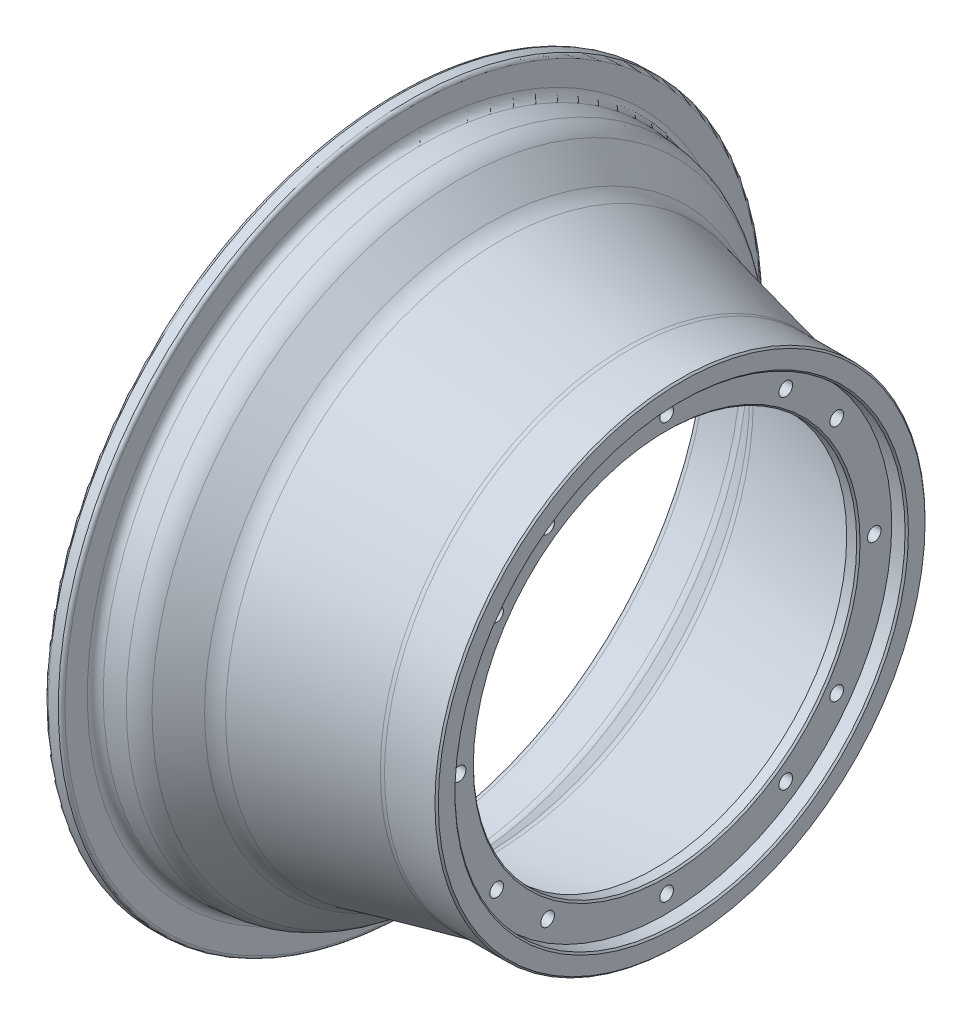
ISO-10303-21;
HEADER;
FILE_DESCRIPTION(('STEP AP214'),'2;1');
FILE_NAME('part.step','',(''),(''),'','','');
FILE_SCHEMA(('AUTOMOTIVE_DESIGN { 1 0 10303 214 1 1 1 1 }'));
ENDSEC;
DATA;
#1=APPLICATION_CONTEXT('core data for automotive mechanical design processes');
#2=APPLICATION_PROTOCOL_DEFINITION('international standard','automotive_design',2000,#1);
#3=PRODUCT_CONTEXT('',#1,'mechanical');
#4=PRODUCT('Part','Part','',(#3));
#5=PRODUCT_RELATED_PRODUCT_CATEGORY('part','',(#4));
#6=PRODUCT_DEFINITION_FORMATION('','',#4);
#7=PRODUCT_DEFINITION_CONTEXT('part definition',#1,'design');
#8=PRODUCT_DEFINITION('design','',#6,#7);
#9=PRODUCT_DEFINITION_SHAPE('','',#8);
#10=(LENGTH_UNIT() NAMED_UNIT(*) SI_UNIT(.MILLI.,.METRE.));
#11=(NAMED_UNIT(*) PLANE_ANGLE_UNIT() SI_UNIT($,.RADIAN.));
#12=(NAMED_UNIT(*) SI_UNIT($,.STERADIAN.) SOLID_ANGLE_UNIT());
#13=UNCERTAINTY_MEASURE_WITH_UNIT(LENGTH_MEASURE(1.E-05),#10,'distance_accuracy_value','');
#14=(GEOMETRIC_REPRESENTATION_CONTEXT(3) GLOBAL_UNCERTAINTY_ASSIGNED_CONTEXT((#13)) GLOBAL_UNIT_ASSIGNED_CONTEXT((#10,
#11,#12)) REPRESENTATION_CONTEXT('',''));
#15=CARTESIAN_POINT('',(0.,0.,0.));
#16=DIRECTION('',(0.,0.,1.));
#17=DIRECTION('',(1.,0.,0.));
#18=AXIS2_PLACEMENT_3D('',#15,#16,#17);
#19=CARTESIAN_POINT('',(0.,135.,0.));
#20=DIRECTION('',(1.,0.,0.));
#21=DIRECTION('',(0.,0.,-1.));
#22=AXIS2_PLACEMENT_3D('',#19,#20,#21);
#23=PLANE('',#22);
#24=CARTESIAN_POINT('',(0.,0.,0.));
#25=DIRECTION('',(1.,0.,0.));
#26=DIRECTION('',(0.,0.,-1.));
#27=AXIS2_PLACEMENT_3D('',#24,#25,#26);
#28=CIRCLE('',#27,136.);
#29=CARTESIAN_POINT('',(0.,0.,-136.));
#30=VERTEX_POINT('',#29);
#31=EDGE_CURVE('E80',#30,#30,#28,.F.);
#32=ORIENTED_EDGE('',*,*,#31,.T.);
#33=EDGE_LOOP('',(#32));
#34=FACE_BOUND('',#33,.T.);
#35=CARTESIAN_POINT('',(0.,0.,0.));
#36=DIRECTION('',(1.,0.,0.));
#37=DIRECTION('',(0.,0.,-1.));
#38=AXIS2_PLACEMENT_3D('',#35,#36,#37);
#39=CIRCLE('',#38,146.);
#40=CARTESIAN_POINT('',(0.,0.,-146.));
#41=VERTEX_POINT('',#40);
#42=EDGE_CURVE('E83',#41,#41,#39,.T.);
#43=ORIENTED_EDGE('',*,*,#42,.T.);
#44=EDGE_LOOP('',(#43));
#45=FACE_BOUND('',#44,.T.);
#46=ADVANCED_FACE('F34',(#34,#45),#23,.T.);
#47=CARTESIAN_POINT('',(0.,0.,0.));
#48=DIRECTION('',(1.,0.,0.));
#49=DIRECTION('',(0.,0.,-1.));
#50=AXIS2_PLACEMENT_3D('',#47,#48,#49);
#51=CYLINDRICAL_SURFACE('',#50,135.);
#52=CARTESIAN_POINT('',(-1.00000000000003,0.,0.));
#53=DIRECTION('',(1.,0.,0.));
#54=DIRECTION('',(0.,0.,-1.));
#55=AXIS2_PLACEMENT_3D('',#52,#53,#54);
#56=CIRCLE('',#55,135.);
#57=CARTESIAN_POINT('',(-1.00000000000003,0.,-135.));
#58=VERTEX_POINT('',#57);
#59=EDGE_CURVE('E86',#58,#58,#56,.T.);
#60=ORIENTED_EDGE('',*,*,#59,.T.);
#61=EDGE_LOOP('',(#60));
#62=FACE_BOUND('',#61,.T.);
#63=CARTESIAN_POINT('',(-9.,0.,0.));
#64=DIRECTION('',(1.,0.,0.));
#65=DIRECTION('',(0.,0.,-1.));
#66=AXIS2_PLACEMENT_3D('',#63,#64,#65);
#67=CIRCLE('',#66,135.);
#68=CARTESIAN_POINT('',(-9.,0.,-135.));
#69=VERTEX_POINT('',#68);
#70=EDGE_CURVE('E125',#69,#69,#67,.T.);
#71=ORIENTED_EDGE('',*,*,#70,.F.);
#72=EDGE_LOOP('',(#71));
#73=FACE_BOUND('',#72,.T.);
#74=ADVANCED_FACE('F304',(#62,#73),#51,.F.);
#75=CARTESIAN_POINT('',(-9.,135.,0.));
#76=DIRECTION('',(1.,0.,0.));
#77=DIRECTION('',(0.,0.,-1.));
#78=AXIS2_PLACEMENT_3D('',#75,#76,#77);
#79=PLANE('',#78);
#80=CARTESIAN_POINT('',(-9.,0.,0.));
#81=DIRECTION('',(1.,0.,0.));
#82=DIRECTION('',(0.,0.,-1.));
#83=AXIS2_PLACEMENT_3D('',#80,#81,#82);
#84=CIRCLE('',#83,116.);
#85=CARTESIAN_POINT('',(-9.,0.,-116.));
#86=VERTEX_POINT('',#85);
#87=EDGE_CURVE('E89',#86,#86,#84,.F.);
#88=ORIENTED_EDGE('',*,*,#87,.T.);
#89=EDGE_LOOP('',(#88));
#90=FACE_BOUND('',#89,.T.);
#91=CARTESIAN_POINT('',(-9.,-4.3468942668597E-13,124.5));
#92=DIRECTION('',(1.,0.,0.));
#93=DIRECTION('',(0.,0.,-1.));
#94=AXIS2_PLACEMENT_3D('',#91,#92,#93);
#95=CIRCLE('',#94,4.1);
#96=CARTESIAN_POINT('',(-9.,-4.3468942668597E-13,120.4));
#97=VERTEX_POINT('',#96);
#98=EDGE_CURVE('E145',#97,#97,#95,.T.);
#99=ORIENTED_EDGE('',*,*,#98,.F.);
#100=EDGE_LOOP('',(#99));
#101=FACE_BOUND('',#100,.T.);
#102=CARTESIAN_POINT('',(-9.,101.98442951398,-71.4102663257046));
#103=DIRECTION('',(1.,0.,0.));
#104=DIRECTION('',(0.,0.,-1.));
#105=AXIS2_PLACEMENT_3D('',#102,#103,#104);
#106=CIRCLE('',#105,4.1);
#107=CARTESIAN_POINT('',(-9.,101.98442951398,-75.5102663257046));
#108=VERTEX_POINT('',#107);
#109=EDGE_CURVE('E152',#108,#108,#106,.T.);
#110=ORIENTED_EDGE('',*,*,#109,.F.);
#111=EDGE_LOOP('',(#110));
#112=FACE_BOUND('',#111,.T.);
#113=CARTESIAN_POINT('',(-9.,71.4102663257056,-101.984429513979));
#114=DIRECTION('',(1.,0.,0.));
#115=DIRECTION('',(0.,0.,-1.));
#116=AXIS2_PLACEMENT_3D('',#113,#114,#115);
#117=CIRCLE('',#116,4.1);
#118=CARTESIAN_POINT('',(-9.,71.4102663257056,-106.084429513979));
#119=VERTEX_POINT('',#118);
#120=EDGE_CURVE('E155',#119,#119,#117,.T.);
#121=ORIENTED_EDGE('',*,*,#120,.F.);
#122=EDGE_LOOP('',(#121));
#123=FACE_BOUND('',#122,.T.);
#124=CARTESIAN_POINT('',(-9.,1.30406828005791E-12,-124.5));
#125=DIRECTION('',(1.,0.,0.));
#126=DIRECTION('',(0.,0.,-1.));
#127=AXIS2_PLACEMENT_3D('',#124,#125,#126);
#128=CIRCLE('',#127,4.1);
#129=CARTESIAN_POINT('',(-9.,1.30406828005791E-12,-128.6));
#130=VERTEX_POINT('',#129);
#131=EDGE_CURVE('E158',#130,#130,#128,.T.);
#132=ORIENTED_EDGE('',*,*,#131,.F.);
#133=EDGE_LOOP('',(#132));
#134=FACE_BOUND('',#133,.T.);
#135=CARTESIAN_POINT('',(-9.,-71.4102663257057,-101.984429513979));
#136=DIRECTION('',(1.,0.,0.));
#137=DIRECTION('',(0.,0.,-1.));
#138=AXIS2_PLACEMENT_3D('',#135,#136,#137);
#139=CIRCLE('',#138,4.1);
#140=CARTESIAN_POINT('',(-9.,-71.4102663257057,-106.084429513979));
#141=VERTEX_POINT('',#140);
#142=EDGE_CURVE('E161',#141,#141,#139,.T.);
#143=ORIENTED_EDGE('',*,*,#142,.F.);
#144=EDGE_LOOP('',(#143));
#145=FACE_BOUND('',#144,.T.);
#146=CARTESIAN_POINT('',(-9.,-101.98442951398,-71.4102663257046));
#147=DIRECTION('',(1.,0.,0.));
#148=DIRECTION('',(0.,0.,-1.));
#149=AXIS2_PLACEMENT_3D('',#146,#147,#148);
#150=CIRCLE('',#149,4.1);
#151=CARTESIAN_POINT('',(-9.,-101.98442951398,-75.5102663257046));
#152=VERTEX_POINT('',#151);
#153=EDGE_CURVE('E164',#152,#152,#150,.T.);
#154=ORIENTED_EDGE('',*,*,#153,.F.);
#155=EDGE_LOOP('',(#154));
#156=FACE_BOUND('',#155,.T.);
#157=CARTESIAN_POINT('',(-9.,-124.5,0.));
#158=DIRECTION('',(1.,0.,0.));
#159=DIRECTION('',(0.,0.,-1.));
#160=AXIS2_PLACEMENT_3D('',#157,#158,#159);
#161=CIRCLE('',#160,4.1);
#162=CARTESIAN_POINT('',(-9.,-124.5,-4.1));
#163=VERTEX_POINT('',#162);
#164=EDGE_CURVE('E167',#163,#163,#161,.T.);
#165=ORIENTED_EDGE('',*,*,#164,.F.);
#166=EDGE_LOOP('',(#165));
#167=FACE_BOUND('',#166,.T.);
#168=CARTESIAN_POINT('',(-9.,-101.984429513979,71.4102663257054));
#169=DIRECTION('',(1.,0.,0.));
#170=DIRECTION('',(0.,0.,-1.));
#171=AXIS2_PLACEMENT_3D('',#168,#169,#170);
#172=CIRCLE('',#171,4.1);
#173=CARTESIAN_POINT('',(-9.,-101.984429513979,67.3102663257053));
#174=VERTEX_POINT('',#173);
#175=EDGE_CURVE('E170',#174,#174,#172,.T.);
#176=ORIENTED_EDGE('',*,*,#175,.F.);
#177=EDGE_LOOP('',(#176));
#178=FACE_BOUND('',#177,.T.);
#179=CARTESIAN_POINT('',(-9.,-71.4102663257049,101.98442951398));
#180=DIRECTION('',(1.,0.,0.));
#181=DIRECTION('',(0.,0.,-1.));
#182=AXIS2_PLACEMENT_3D('',#179,#180,#181);
#183=CIRCLE('',#182,4.1);
#184=CARTESIAN_POINT('',(-9.,-71.4102663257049,97.8844295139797));
#185=VERTEX_POINT('',#184);
#186=EDGE_CURVE('E173',#185,#185,#183,.T.);
#187=ORIENTED_EDGE('',*,*,#186,.F.);
#188=EDGE_LOOP('',(#187));
#189=FACE_BOUND('',#188,.T.);
#190=CARTESIAN_POINT('',(-9.,124.5,0.));
#191=DIRECTION('',(1.,0.,0.));
#192=DIRECTION('',(0.,0.,-1.));
#193=AXIS2_PLACEMENT_3D('',#190,#191,#192);
#194=CIRCLE('',#193,4.1);
#195=CARTESIAN_POINT('',(-9.,124.5,-4.1));
#196=VERTEX_POINT('',#195);
#197=EDGE_CURVE('E131',#196,#196,#194,.T.);
#198=ORIENTED_EDGE('',*,*,#197,.F.);
#199=EDGE_LOOP('',(#198));
#200=FACE_BOUND('',#199,.T.);
#201=CARTESIAN_POINT('',(-9.,101.98442951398,71.4102663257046));
#202=DIRECTION('',(1.,0.,0.));
#203=DIRECTION('',(0.,0.,-1.));
#204=AXIS2_PLACEMENT_3D('',#201,#202,#203);
#205=CIRCLE('',#204,4.1);
#206=CARTESIAN_POINT('',(-9.,101.98442951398,67.3102663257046));
#207=VERTEX_POINT('',#206);
#208=EDGE_CURVE('E134',#207,#207,#205,.T.);
#209=ORIENTED_EDGE('',*,*,#208,.F.);
#210=EDGE_LOOP('',(#209));
#211=FACE_BOUND('',#210,.T.);
#212=CARTESIAN_POINT('',(-9.,71.4102663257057,101.984429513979));
#213=DIRECTION('',(1.,0.,0.));
#214=DIRECTION('',(0.,0.,-1.));
#215=AXIS2_PLACEMENT_3D('',#212,#213,#214);
#216=CIRCLE('',#215,4.1);
#217=CARTESIAN_POINT('',(-9.,71.4102663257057,97.8844295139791));
#218=VERTEX_POINT('',#217);
#219=EDGE_CURVE('E137',#218,#218,#216,.T.);
#220=ORIENTED_EDGE('',*,*,#219,.F.);
#221=EDGE_LOOP('',(#220));
#222=FACE_BOUND('',#221,.T.);
#223=ORIENTED_EDGE('',*,*,#70,.T.);
#224=EDGE_LOOP('',(#223));
#225=FACE_BOUND('',#224,.T.);
#226=ADVANCED_FACE('F310',(#90,#101,#112,#123,#134,#145,#156,#167,#178,#189,#200,#211,#222,
#225),#79,.T.);
#227=CARTESIAN_POINT('',(0.,0.,0.));
#228=DIRECTION('',(1.,0.,0.));
#229=DIRECTION('',(0.,0.,-1.));
#230=AXIS2_PLACEMENT_3D('',#227,#228,#229);
#231=CYLINDRICAL_SURFACE('',#230,115.);
#232=CARTESIAN_POINT('',(-9.99999999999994,0.,0.));
#233=DIRECTION('',(1.,0.,0.));
#234=DIRECTION('',(0.,0.,-1.));
#235=AXIS2_PLACEMENT_3D('',#232,#233,#234);
#236=CIRCLE('',#235,115.);
#237=CARTESIAN_POINT('',(-9.99999999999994,0.,-115.));
#238=VERTEX_POINT('',#237);
#239=EDGE_CURVE('E92',#238,#238,#236,.T.);
#240=ORIENTED_EDGE('',*,*,#239,.T.);
#241=EDGE_LOOP('',(#240));
#242=FACE_BOUND('',#241,.T.);
#243=CARTESIAN_POINT('',(-16.,0.,0.));
#244=DIRECTION('',(1.,0.,0.));
#245=DIRECTION('',(0.,0.,-1.));
#246=AXIS2_PLACEMENT_3D('',#243,#244,#245);
#247=CIRCLE('',#246,115.);
#248=CARTESIAN_POINT('',(-16.,0.,-115.));
#249=VERTEX_POINT('',#248);
#250=EDGE_CURVE('E128',#249,#249,#247,.T.);
#251=ORIENTED_EDGE('',*,*,#250,.F.);
#252=EDGE_LOOP('',(#251));
#253=FACE_BOUND('',#252,.T.);
#254=ADVANCED_FACE('F422',(#242,#253),#231,.F.);
#255=CARTESIAN_POINT('',(-16.,115.,0.));
#256=DIRECTION('',(-1.,0.,0.));
#257=DIRECTION('',(0.,0.,1.));
#258=AXIS2_PLACEMENT_3D('',#255,#256,#257);
#259=PLANE('',#258);
#260=CARTESIAN_POINT('',(-16.,0.,0.));
#261=DIRECTION('',(-1.,0.,0.));
#262=DIRECTION('',(0.,0.,1.));
#263=AXIS2_PLACEMENT_3D('',#260,#261,#262);
#264=CIRCLE('',#263,133.409128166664);
#265=CARTESIAN_POINT('',(-16.,0.,133.409128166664));
#266=VERTEX_POINT('',#265);
#267=EDGE_CURVE('E71',#266,#266,#264,.T.);
#268=ORIENTED_EDGE('',*,*,#267,.T.);
#269=EDGE_LOOP('',(#268));
#270=FACE_BOUND('',#269,.T.);
#271=CARTESIAN_POINT('',(-16.,-4.3468942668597E-13,124.5));
#272=DIRECTION('',(-1.,0.,0.));
#273=DIRECTION('',(0.,-1.,0.));
#274=AXIS2_PLACEMENT_3D('',#271,#272,#273);
#275=CIRCLE('',#274,4.1);
#276=CARTESIAN_POINT('',(-16.,-4.10000000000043,124.5));
#277=VERTEX_POINT('',#276);
#278=EDGE_CURVE('E176',#277,#277,#275,.T.);
#279=ORIENTED_EDGE('',*,*,#278,.F.);
#280=EDGE_LOOP('',(#279));
#281=FACE_BOUND('',#280,.T.);
#282=CARTESIAN_POINT('',(-16.,101.98442951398,-71.4102663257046));
#283=DIRECTION('',(-1.,0.,0.));
#284=DIRECTION('',(0.,1.,0.));
#285=AXIS2_PLACEMENT_3D('',#282,#283,#284);
#286=CIRCLE('',#285,4.1);
#287=CARTESIAN_POINT('',(-16.,106.08442951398,-71.4102663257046));
#288=VERTEX_POINT('',#287);
#289=EDGE_CURVE('E190',#288,#288,#286,.T.);
#290=ORIENTED_EDGE('',*,*,#289,.F.);
#291=EDGE_LOOP('',(#290));
#292=FACE_BOUND('',#291,.T.);
#293=CARTESIAN_POINT('',(-16.,71.4102663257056,-101.984429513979));
#294=DIRECTION('',(-1.,0.,0.));
#295=DIRECTION('',(0.,1.,0.));
#296=AXIS2_PLACEMENT_3D('',#293,#294,#295);
#297=CIRCLE('',#296,4.1);
#298=CARTESIAN_POINT('',(-16.,75.5102663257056,-101.984429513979));
#299=VERTEX_POINT('',#298);
#300=EDGE_CURVE('E193',#299,#299,#297,.T.);
#301=ORIENTED_EDGE('',*,*,#300,.F.);
#302=EDGE_LOOP('',(#301));
#303=FACE_BOUND('',#302,.T.);
#304=CARTESIAN_POINT('',(-16.,1.30406828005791E-12,-124.5));
#305=DIRECTION('',(-1.,0.,0.));
#306=DIRECTION('',(0.,1.,0.));
#307=AXIS2_PLACEMENT_3D('',#304,#305,#306);
#308=CIRCLE('',#307,4.1);
#309=CARTESIAN_POINT('',(-16.,4.1000000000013,-124.5));
#310=VERTEX_POINT('',#309);
#311=EDGE_CURVE('E197',#310,#310,#308,.T.);
#312=ORIENTED_EDGE('',*,*,#311,.F.);
#313=EDGE_LOOP('',(#312));
#314=FACE_BOUND('',#313,.T.);
#315=CARTESIAN_POINT('',(-16.,-71.4102663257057,-101.984429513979));
#316=DIRECTION('',(-1.,0.,0.));
#317=DIRECTION('',(0.,0.,-1.));
#318=AXIS2_PLACEMENT_3D('',#315,#316,#317);
#319=CIRCLE('',#318,4.1);
#320=CARTESIAN_POINT('',(-16.,-71.4102663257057,-106.084429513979));
#321=VERTEX_POINT('',#320);
#322=EDGE_CURVE('E181',#321,#321,#319,.T.);
#323=ORIENTED_EDGE('',*,*,#322,.F.);
#324=EDGE_LOOP('',(#323));
#325=FACE_BOUND('',#324,.T.);
#326=CARTESIAN_POINT('',(-16.,-101.98442951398,-71.4102663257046));
#327=DIRECTION('',(-1.,0.,0.));
#328=DIRECTION('',(0.,0.,-1.));
#329=AXIS2_PLACEMENT_3D('',#326,#327,#328);
#330=CIRCLE('',#329,4.1);
#331=CARTESIAN_POINT('',(-16.,-101.98442951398,-75.5102663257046));
#332=VERTEX_POINT('',#331);
#333=EDGE_CURVE('E177',#332,#332,#330,.T.);
#334=ORIENTED_EDGE('',*,*,#333,.F.);
#335=EDGE_LOOP('',(#334));
#336=FACE_BOUND('',#335,.T.);
#337=CARTESIAN_POINT('',(-16.,-124.5,0.));
#338=DIRECTION('',(-1.,0.,0.));
#339=DIRECTION('',(0.,0.,-1.));
#340=AXIS2_PLACEMENT_3D('',#337,#338,#339);
#341=CIRCLE('',#340,4.1);
#342=CARTESIAN_POINT('',(-16.,-124.5,-4.1));
#343=VERTEX_POINT('',#342);
#344=EDGE_CURVE('E180',#343,#343,#341,.T.);
#345=ORIENTED_EDGE('',*,*,#344,.F.);
#346=EDGE_LOOP('',(#345));
#347=FACE_BOUND('',#346,.T.);
#348=CARTESIAN_POINT('',(-16.,-101.984429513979,71.4102663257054));
#349=DIRECTION('',(-1.,0.,0.));
#350=DIRECTION('',(0.,-1.,0.));
#351=AXIS2_PLACEMENT_3D('',#348,#349,#350);
#352=CIRCLE('',#351,4.1);
#353=CARTESIAN_POINT('',(-16.,-106.084429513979,71.4102663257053));
#354=VERTEX_POINT('',#353);
#355=EDGE_CURVE('E184',#354,#354,#352,.T.);
#356=ORIENTED_EDGE('',*,*,#355,.F.);
#357=EDGE_LOOP('',(#356));
#358=FACE_BOUND('',#357,.T.);
#359=CARTESIAN_POINT('',(-16.,-71.4102663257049,101.98442951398));
#360=DIRECTION('',(-1.,0.,0.));
#361=DIRECTION('',(0.,-1.,0.));
#362=AXIS2_PLACEMENT_3D('',#359,#360,#361);
#363=CIRCLE('',#362,4.1);
#364=CARTESIAN_POINT('',(-16.,-75.5102663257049,101.98442951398));
#365=VERTEX_POINT('',#364);
#366=EDGE_CURVE('E187',#365,#365,#363,.T.);
#367=ORIENTED_EDGE('',*,*,#366,.F.);
#368=EDGE_LOOP('',(#367));
#369=FACE_BOUND('',#368,.T.);
#370=CARTESIAN_POINT('',(-16.,124.5,0.));
#371=DIRECTION('',(-1.,0.,0.));
#372=DIRECTION('',(0.,0.,1.));
#373=AXIS2_PLACEMENT_3D('',#370,#371,#372);
#374=CIRCLE('',#373,4.1);
#375=CARTESIAN_POINT('',(-16.,124.5,4.1));
#376=VERTEX_POINT('',#375);
#377=EDGE_CURVE('E140',#376,#376,#374,.T.);
#378=ORIENTED_EDGE('',*,*,#377,.F.);
#379=EDGE_LOOP('',(#378));
#380=FACE_BOUND('',#379,.T.);
#381=CARTESIAN_POINT('',(-16.,101.98442951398,71.4102663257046));
#382=DIRECTION('',(-1.,0.,0.));
#383=DIRECTION('',(0.,0.,1.));
#384=AXIS2_PLACEMENT_3D('',#381,#382,#383);
#385=CIRCLE('',#384,4.1);
#386=CARTESIAN_POINT('',(-16.,101.98442951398,75.5102663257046));
#387=VERTEX_POINT('',#386);
#388=EDGE_CURVE('E144',#387,#387,#385,.T.);
#389=ORIENTED_EDGE('',*,*,#388,.F.);
#390=EDGE_LOOP('',(#389));
#391=FACE_BOUND('',#390,.T.);
#392=CARTESIAN_POINT('',(-16.,71.4102663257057,101.984429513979));
#393=DIRECTION('',(-1.,0.,0.));
#394=DIRECTION('',(0.,0.,1.));
#395=AXIS2_PLACEMENT_3D('',#392,#393,#394);
#396=CIRCLE('',#395,4.1);
#397=CARTESIAN_POINT('',(-16.,71.4102663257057,106.084429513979));
#398=VERTEX_POINT('',#397);
#399=EDGE_CURVE('E141',#398,#398,#396,.T.);
#400=ORIENTED_EDGE('',*,*,#399,.F.);
#401=EDGE_LOOP('',(#400));
#402=FACE_BOUND('',#401,.T.);
#403=ORIENTED_EDGE('',*,*,#250,.T.);
#404=EDGE_LOOP('',(#403));
#405=FACE_BOUND('',#404,.T.);
#406=ADVANCED_FACE('F415',(#270,#281,#292,#303,#314,#325,#336,#347,#358,#369,#380,#391,#402,
#405),#259,.T.);
#407=CARTESIAN_POINT('',(-117.476104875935,0.,0.));
#408=DIRECTION('',(-1.,0.,0.));
#409=DIRECTION('',(0.,0.,1.));
#410=AXIS2_PLACEMENT_3D('',#407,#408,#409);
#411=CONICAL_SURFACE('',#410,158.427604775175,0.226892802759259);
#412=CARTESIAN_POINT('',(-17.5500978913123,0.,0.));
#413=DIRECTION('',(-1.,0.,0.));
#414=DIRECTION('',(0.,0.,1.));
#415=AXIS2_PLACEMENT_3D('',#412,#413,#414);
#416=CIRCLE('',#415,135.357868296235);
#417=CARTESIAN_POINT('',(-17.5500978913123,0.,135.357868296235));
#418=VERTEX_POINT('',#417);
#419=EDGE_CURVE('E74',#418,#418,#416,.F.);
#420=ORIENTED_EDGE('',*,*,#419,.T.);
#421=EDGE_LOOP('',(#420));
#422=FACE_BOUND('',#421,.T.);
#423=CARTESIAN_POINT('',(-114.867311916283,0.,0.));
#424=DIRECTION('',(1.,0.,0.));
#425=DIRECTION('',(0.,0.,-1.));
#426=AXIS2_PLACEMENT_3D('',#423,#424,#425);
#427=CIRCLE('',#426,157.825317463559);
#428=CARTESIAN_POINT('',(-114.867311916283,0.,-157.825317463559));
#429=VERTEX_POINT('',#428);
#430=EDGE_CURVE('E113',#429,#429,#427,.F.);
#431=ORIENTED_EDGE('',*,*,#430,.T.);
#432=EDGE_LOOP('',(#431));
#433=FACE_BOUND('',#432,.T.);
#434=ADVANCED_FACE('F300',(#422,#433),#411,.F.);
#435=CARTESIAN_POINT('',(-141.4,0.,0.));
#436=DIRECTION('',(-1.,0.,0.));
#437=DIRECTION('',(0.,0.,1.));
#438=AXIS2_PLACEMENT_3D('',#435,#436,#437);
#439=CONICAL_SURFACE('',#438,180.719668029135,0.750103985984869);
#440=CARTESIAN_POINT('',(-132.745387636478,-172.620041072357,-3.49311851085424));
#441=CARTESIAN_POINT('',(-132.815787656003,-172.688425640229,-3.35608410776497));
#442=CARTESIAN_POINT('',(-132.881993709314,-172.752818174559,-3.21492792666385));
#443=CARTESIAN_POINT('',(-133.005616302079,-172.873172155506,-2.92529669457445));
#444=CARTESIAN_POINT('',(-133.063030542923,-172.929131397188,-2.77681974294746));
#445=CARTESIAN_POINT('',(-133.168706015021,-173.032213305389,-2.47351104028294));
#446=CARTESIAN_POINT('',(-133.216959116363,-173.079328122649,-2.31867379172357));
#447=CARTESIAN_POINT('',(-133.303945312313,-173.164318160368,-2.00380823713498));
#448=CARTESIAN_POINT('',(-133.342674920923,-173.202189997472,-1.84377805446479));
#449=CARTESIAN_POINT('',(-133.410304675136,-173.26835434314,-1.51985507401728));
#450=CARTESIAN_POINT('',(-133.439212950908,-173.296654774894,-1.35596559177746));
#451=CARTESIAN_POINT('',(-133.487061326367,-173.343512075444,-1.02529982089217));
#452=CARTESIAN_POINT('',(-133.505997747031,-173.362065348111,-0.85852249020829));
#453=CARTESIAN_POINT('',(-133.533751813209,-173.389261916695,-0.523430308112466));
#454=CARTESIAN_POINT('',(-133.542575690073,-173.397911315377,-0.355116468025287));
#455=CARTESIAN_POINT('',(-133.550068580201,-173.405255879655,-0.0179838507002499));
#456=CARTESIAN_POINT('',(-133.548733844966,-173.403947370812,0.150835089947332));
#457=CARTESIAN_POINT('',(-133.535912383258,-173.3913802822,0.48763874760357));
#458=CARTESIAN_POINT('',(-133.524430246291,-173.380126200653,0.655623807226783));
#459=CARTESIAN_POINT('',(-133.491390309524,-173.34775429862,0.989704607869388));
#460=CARTESIAN_POINT('',(-133.469828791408,-173.326632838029,1.15579962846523));
#461=CARTESIAN_POINT('',(-133.416780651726,-173.27469507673,1.48480175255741));
#462=CARTESIAN_POINT('',(-133.385297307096,-173.243881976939,1.64770988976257));
#463=CARTESIAN_POINT('',(-133.312599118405,-173.172781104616,1.96929663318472));
#464=CARTESIAN_POINT('',(-133.271380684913,-173.132489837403,2.12797365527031));
#465=CARTESIAN_POINT('',(-133.179507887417,-173.042760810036,2.4398551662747));
#466=CARTESIAN_POINT('',(-133.128856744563,-172.993326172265,2.59306150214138));
#467=CARTESIAN_POINT('',(-133.01842867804,-172.885659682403,2.8930235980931));
#468=CARTESIAN_POINT('',(-132.958648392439,-172.827424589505,3.03977695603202));
#469=CARTESIAN_POINT('',(-132.830389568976,-172.702626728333,3.32568707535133));
#470=CARTESIAN_POINT('',(-132.761914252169,-172.636067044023,3.46484662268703));
#471=CARTESIAN_POINT('',(-132.616713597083,-172.495112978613,3.73465371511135));
#472=CARTESIAN_POINT('',(-132.539985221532,-172.420715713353,3.86529809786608));
#473=CARTESIAN_POINT('',(-132.298164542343,-172.186581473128,4.24299114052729));
#474=CARTESIAN_POINT('',(-132.12133452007,-172.015802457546,4.47602719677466));
#475=CARTESIAN_POINT('',(-131.741497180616,-171.650250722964,4.89739590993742));
#476=CARTESIAN_POINT('',(-131.538489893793,-171.455478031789,5.08572861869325));
#477=CARTESIAN_POINT('',(-131.111704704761,-171.047599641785,5.412548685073));
#478=CARTESIAN_POINT('',(-130.887924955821,-170.834492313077,5.55103160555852));
#479=CARTESIAN_POINT('',(-130.425794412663,-170.396242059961,5.77414192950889));
#480=CARTESIAN_POINT('',(-130.187443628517,-170.171099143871,5.85876937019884));
#481=CARTESIAN_POINT('',(-129.702861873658,-169.715364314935,5.97176038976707));
#482=CARTESIAN_POINT('',(-129.456632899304,-169.484773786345,6.00013810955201));
#483=CARTESIAN_POINT('',(-128.963177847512,-169.024698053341,5.99986087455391));
#484=CARTESIAN_POINT('',(-128.715951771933,-168.795212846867,5.97120602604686));
#485=CARTESIAN_POINT('',(-128.227605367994,-168.343878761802,5.85769212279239));
#486=CARTESIAN_POINT('',(-127.986483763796,-168.122028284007,5.77284491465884));
#487=CARTESIAN_POINT('',(-127.517248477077,-167.692084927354,5.54936968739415));
#488=CARTESIAN_POINT('',(-127.289134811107,-167.483992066,5.41074159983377));
#489=CARTESIAN_POINT('',(-126.85253577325,-167.087233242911,5.08361501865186));
#490=CARTESIAN_POINT('',(-126.644053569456,-166.898570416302,4.89510849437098));
#491=CARTESIAN_POINT('',(-126.252907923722,-166.545803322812,4.473584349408));
#492=CARTESIAN_POINT('',(-126.070244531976,-166.381699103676,4.24056664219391));
#493=CARTESIAN_POINT('',(-125.736130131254,-166.08237725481,3.73655503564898));
#494=CARTESIAN_POINT('',(-125.584688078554,-165.947167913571,3.46555027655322));
#495=CARTESIAN_POINT('',(-125.317637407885,-165.709257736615,2.89330275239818));
#496=CARTESIAN_POINT('',(-125.202028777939,-165.606556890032,2.5920599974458));
#497=CARTESIAN_POINT('',(-125.010153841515,-165.436349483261,1.96789920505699));
#498=CARTESIAN_POINT('',(-124.93388569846,-165.368841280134,1.64498218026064));
#499=CARTESIAN_POINT('',(-124.823009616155,-165.270764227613,0.98662914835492));
#500=CARTESIAN_POINT('',(-124.788401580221,-165.24019529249,0.651193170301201));
#501=CARTESIAN_POINT('',(-124.761908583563,-165.216790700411,-0.022562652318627));
#502=CARTESIAN_POINT('',(-124.77001017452,-165.223943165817,-0.360881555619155));
#503=CARTESIAN_POINT('',(-124.828657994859,-165.275769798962,-1.03090223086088));
#504=CARTESIAN_POINT('',(-124.879204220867,-165.320443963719,-1.36260400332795));
#505=CARTESIAN_POINT('',(-125.021188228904,-165.446150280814,-2.00994665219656));
#506=CARTESIAN_POINT('',(-125.112622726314,-165.527179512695,-2.32558881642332));
#507=CARTESIAN_POINT('',(-125.333612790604,-165.723499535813,-2.93189708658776));
#508=CARTESIAN_POINT('',(-125.463168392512,-165.838790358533,-3.22256316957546));
#509=CARTESIAN_POINT('',(-125.75648910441,-166.100616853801,-3.77072674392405));
#510=CARTESIAN_POINT('',(-125.920263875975,-166.247161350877,-4.02821483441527));
#511=CARTESIAN_POINT('',(-126.277243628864,-166.567738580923,-4.50273983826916));
#512=CARTESIAN_POINT('',(-126.470448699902,-166.741771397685,-4.71977662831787));
#513=CARTESIAN_POINT('',(-126.777735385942,-167.01967463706,-5.010175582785));
#514=CARTESIAN_POINT('',(-126.883149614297,-167.115183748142,-5.10116222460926));
#515=CARTESIAN_POINT('',(-127.099072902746,-167.311213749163,-5.27082782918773));
#516=CARTESIAN_POINT('',(-127.209580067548,-167.411732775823,-5.34951132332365));
#517=CARTESIAN_POINT('',(-127.434925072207,-167.617139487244,-5.49403518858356));
#518=CARTESIAN_POINT('',(-127.54976450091,-167.722028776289,-5.55987079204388));
#519=CARTESIAN_POINT('',(-127.782861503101,-167.935386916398,-5.6781832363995));
#520=CARTESIAN_POINT('',(-127.901117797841,-168.043854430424,-5.73066500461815));
#521=CARTESIAN_POINT('',(-128.140251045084,-168.263672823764,-5.82193340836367));
#522=CARTESIAN_POINT('',(-128.261128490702,-168.375024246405,-5.86071744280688));
#523=CARTESIAN_POINT('',(-128.50456487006,-168.599771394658,-5.92428916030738));
#524=CARTESIAN_POINT('',(-128.627123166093,-168.713166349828,-5.94908200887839));
#525=CARTESIAN_POINT('',(-128.873126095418,-168.941280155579,-5.98452245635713));
#526=CARTESIAN_POINT('',(-128.996571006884,-169.055999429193,-5.99516540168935));
#527=CARTESIAN_POINT('',(-129.24338070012,-169.285869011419,-6.00221379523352));
#528=CARTESIAN_POINT('',(-129.366745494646,-169.401019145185,-5.99862450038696));
#529=CARTESIAN_POINT('',(-129.612566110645,-169.630970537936,-5.977245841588));
#530=CARTESIAN_POINT('',(-129.735021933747,-169.745771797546,-5.95945650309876));
#531=CARTESIAN_POINT('',(-129.978117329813,-169.974158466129,-5.90981374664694));
#532=CARTESIAN_POINT('',(-130.098757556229,-170.087744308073,-5.87796552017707));
#533=CARTESIAN_POINT('',(-130.337497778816,-170.312991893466,-5.80040890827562));
#534=CARTESIAN_POINT('',(-130.455596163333,-170.424652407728,-5.75469199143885));
#535=CARTESIAN_POINT('',(-130.688310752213,-170.645123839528,-5.64974990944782));
#536=CARTESIAN_POINT('',(-130.802928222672,-170.753935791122,-5.59052972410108));
#537=CARTESIAN_POINT('',(-131.028038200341,-170.968055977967,-5.45893188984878));
#538=CARTESIAN_POINT('',(-131.138526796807,-171.07336088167,-5.38654212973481));
#539=CARTESIAN_POINT('',(-131.354466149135,-171.279547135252,-5.22918688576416));
#540=CARTESIAN_POINT('',(-131.459918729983,-171.380430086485,-5.14422600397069));
#541=CARTESIAN_POINT('',(-131.665018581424,-171.57698161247,-4.96239091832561));
#542=CARTESIAN_POINT('',(-131.764670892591,-171.672654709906,-4.86552729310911));
#543=CARTESIAN_POINT('',(-131.957561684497,-171.858141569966,-4.66055217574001));
#544=CARTESIAN_POINT('',(-132.050801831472,-171.947956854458,-4.55244362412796));
#545=CARTESIAN_POINT('',(-132.253125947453,-172.143138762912,-4.29683719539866));
#546=CARTESIAN_POINT('',(-132.360204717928,-172.246647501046,-4.14631609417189));
#547=CARTESIAN_POINT('',(-132.562184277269,-172.442211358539,-3.83039771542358));
#548=CARTESIAN_POINT('',(-132.657085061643,-172.534266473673,-3.66500043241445));
#549=CARTESIAN_POINT('',(-132.745387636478,-172.620041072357,-3.49311851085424));
#550=B_SPLINE_CURVE_WITH_KNOTS('',3,(#440,#441,#442,#443,#444,#445,#446,#447,#448,#449,#450,
#451,#452,#453,#454,#455,#456,#457,#458,#459,#460,#461,#462,#463,#464,#465,#466,#467,#468,#469,
#470,#471,#472,#473,#474,#475,#476,#477,#478,#479,#480,#481,#482,#483,#484,#485,#486,#487,#488,
#489,#490,#491,#492,#493,#494,#495,#496,#497,#498,#499,#500,#501,#502,#503,#504,#505,#506,#507,
#508,#509,#510,#511,#512,#513,#514,#515,#516,#517,#518,#519,#520,#521,#522,#523,#524,#525,#526,
#527,#528,#529,#530,#531,#532,#533,#534,#535,#536,#537,#538,#539,#540,#541,#542,#543,#544,#545,
#546,#547,#548,#549),.UNSPECIFIED.,.T.,.F.,(4,2,2,2,2,2,2,2,2,2,2,2,2,2,2,2,2,2,2,2,2,2,2,2,2,2,
2,2,2,2,2,2,2,2,2,2,2,2,2,2,2,2,2,2,2,2,2,2,2,2,2,2,2,2,4),(0.,0.505482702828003,
1.01109733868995,1.51715859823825,2.02340482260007,2.52923094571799,3.0352435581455,
3.54094419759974,4.04683144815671,4.55249001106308,5.05833526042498,5.56401361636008,
6.06987871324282,6.5755713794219,7.0814507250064,7.58714321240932,8.09302244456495,
9.10398543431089,10.1149472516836,11.1259990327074,12.1370501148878,13.1478469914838,
14.1586419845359,15.1692239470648,16.1798071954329,17.190553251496,18.2013012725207,
19.2123388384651,20.2233760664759,21.2343660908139,22.2453537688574,23.2560231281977,
24.2666924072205,25.2772805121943,26.2878695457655,27.2987442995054,28.3096221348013,
28.8157010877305,29.3215932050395,29.8276726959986,30.3335651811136,30.8395536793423,
31.3453552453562,31.8513231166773,32.3571041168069,32.8628842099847,33.3684776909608,
33.8743828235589,34.3801016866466,34.8862879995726,35.39228946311,35.8978444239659,
36.4032675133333,37.0372930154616,37.6713187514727),.UNSPECIFIED.);
#551=CARTESIAN_POINT('',(-132.745387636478,-172.620041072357,-3.49311851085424));
#552=VERTEX_POINT('',#551);
#553=EDGE_CURVE('E194',#552,#552,#550,.T.);
#554=ORIENTED_EDGE('',*,*,#553,.F.);
#555=EDGE_LOOP('',(#554));
#556=FACE_BOUND('',#555,.T.);
#557=CARTESIAN_POINT('',(-138.882423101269,0.,0.));
#558=DIRECTION('',(-1.,0.,0.));
#559=DIRECTION('',(0.,0.,1.));
#560=AXIS2_PLACEMENT_3D('',#557,#558,#559);
#561=CIRCLE('',#560,178.373813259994);
#562=CARTESIAN_POINT('',(-138.882423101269,0.,178.373813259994));
#563=VERTEX_POINT('',#562);
#564=EDGE_CURVE('E116',#563,#563,#561,.T.);
#565=ORIENTED_EDGE('',*,*,#564,.T.);
#566=EDGE_LOOP('',(#565));
#567=FACE_BOUND('',#566,.T.);
#568=CARTESIAN_POINT('',(-119.4349497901,0.,0.));
#569=DIRECTION('',(1.,0.,0.));
#570=DIRECTION('',(0.,0.,-1.));
#571=AXIS2_PLACEMENT_3D('',#568,#569,#570);
#572=CIRCLE('',#571,160.252838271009);
#573=CARTESIAN_POINT('',(-119.4349497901,0.,-160.252838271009));
#574=VERTEX_POINT('',#573);
#575=EDGE_CURVE('E119',#574,#574,#572,.T.);
#576=ORIENTED_EDGE('',*,*,#575,.T.);
#577=EDGE_LOOP('',(#576));
#578=FACE_BOUND('',#577,.T.);
#579=ADVANCED_FACE('F209',(#556,#567,#578),#439,.F.);
#580=CARTESIAN_POINT('',(-171.4,0.,0.));
#581=DIRECTION('',(-1.,0.,0.));
#582=DIRECTION('',(0.,0.,1.));
#583=AXIS2_PLACEMENT_3D('',#580,#581,#582);
#584=CONICAL_SURFACE('',#583,183.344327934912,0.0872664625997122);
#585=CARTESIAN_POINT('',(-166.835778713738,0.,0.));
#586=DIRECTION('',(1.,0.,0.));
#587=DIRECTION('',(0.,0.,-1.));
#588=AXIS2_PLACEMENT_3D('',#585,#586,#587);
#589=CIRCLE('',#588,182.945010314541);
#590=CARTESIAN_POINT('',(-166.835778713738,0.,-182.945010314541));
#591=VERTEX_POINT('',#590);
#592=EDGE_CURVE('E65',#591,#591,#589,.F.);
#593=ORIENTED_EDGE('',*,*,#592,.T.);
#594=EDGE_LOOP('',(#593));
#595=FACE_BOUND('',#594,.T.);
#596=CARTESIAN_POINT('',(-144.828014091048,0.,0.));
#597=DIRECTION('',(-1.,0.,0.));
#598=DIRECTION('',(0.,0.,1.));
#599=AXIS2_PLACEMENT_3D('',#596,#597,#598);
#600=CIRCLE('',#599,181.019580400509);
#601=CARTESIAN_POINT('',(-144.828014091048,0.,181.019580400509));
#602=VERTEX_POINT('',#601);
#603=EDGE_CURVE('E122',#602,#602,#600,.F.);
#604=ORIENTED_EDGE('',*,*,#603,.T.);
#605=EDGE_LOOP('',(#604));
#606=FACE_BOUND('',#605,.T.);
#607=ADVANCED_FACE('F294',(#595,#606),#584,.F.);
#608=CARTESIAN_POINT('',(-171.4,183.344327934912,0.));
#609=DIRECTION('',(-1.,0.,0.));
#610=DIRECTION('',(0.,0.,1.));
#611=AXIS2_PLACEMENT_3D('',#608,#609,#610);
#612=PLANE('',#611);
#613=CARTESIAN_POINT('',(-171.4,0.,0.));
#614=DIRECTION('',(-1.,0.,0.));
#615=DIRECTION('',(0.,0.,1.));
#616=AXIS2_PLACEMENT_3D('',#613,#614,#615);
#617=CIRCLE('',#616,208.5);
#618=CARTESIAN_POINT('',(-171.4,0.,208.5));
#619=VERTEX_POINT('',#618);
#620=EDGE_CURVE('E10',#619,#619,#617,.T.);
#621=ORIENTED_EDGE('',*,*,#620,.T.);
#622=EDGE_LOOP('',(#621));
#623=FACE_BOUND('',#622,.T.);
#624=CARTESIAN_POINT('',(-171.4,0.,0.));
#625=DIRECTION('',(-1.,0.,0.));
#626=DIRECTION('',(0.,0.,1.));
#627=AXIS2_PLACEMENT_3D('',#624,#625,#626);
#628=CIRCLE('',#627,187.925983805);
#629=CARTESIAN_POINT('',(-171.4,0.,187.925983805));
#630=VERTEX_POINT('',#629);
#631=EDGE_CURVE('E68',#630,#630,#628,.F.);
#632=ORIENTED_EDGE('',*,*,#631,.T.);
#633=EDGE_LOOP('',(#632));
#634=FACE_BOUND('',#633,.T.);
#635=ADVANCED_FACE('F291',(#623,#634),#612,.T.);
#636=CARTESIAN_POINT('',(0.,0.,0.));
#637=DIRECTION('',(1.,0.,0.));
#638=DIRECTION('',(0.,0.,-1.));
#639=AXIS2_PLACEMENT_3D('',#636,#637,#638);
#640=CYLINDRICAL_SURFACE('',#639,210.5);
#641=CARTESIAN_POINT('',(-163.4,0.,0.));
#642=DIRECTION('',(1.,0.,0.));
#643=DIRECTION('',(0.,0.,-1.));
#644=AXIS2_PLACEMENT_3D('',#641,#642,#643);
#645=CIRCLE('',#644,210.5);
#646=CARTESIAN_POINT('',(-163.4,0.,-210.5));
#647=VERTEX_POINT('',#646);
#648=EDGE_CURVE('E47',#647,#647,#645,.F.);
#649=ORIENTED_EDGE('',*,*,#648,.T.);
#650=EDGE_LOOP('',(#649));
#651=FACE_BOUND('',#650,.T.);
#652=CARTESIAN_POINT('',(-169.4,0.,0.));
#653=DIRECTION('',(-1.,0.,0.));
#654=DIRECTION('',(0.,0.,1.));
#655=AXIS2_PLACEMENT_3D('',#652,#653,#654);
#656=CIRCLE('',#655,210.5);
#657=CARTESIAN_POINT('',(-169.4,0.,210.5));
#658=VERTEX_POINT('',#657);
#659=EDGE_CURVE('E51',#658,#658,#656,.F.);
#660=ORIENTED_EDGE('',*,*,#659,.T.);
#661=EDGE_LOOP('',(#660));
#662=FACE_BOUND('',#661,.T.);
#663=ADVANCED_FACE('F287',(#651,#662),#640,.T.);
#664=CARTESIAN_POINT('',(-161.4,210.5,0.));
#665=DIRECTION('',(1.,0.,0.));
#666=DIRECTION('',(0.,0.,-1.));
#667=AXIS2_PLACEMENT_3D('',#664,#665,#666);
#668=PLANE('',#667);
#669=CARTESIAN_POINT('',(-161.4,0.,0.));
#670=DIRECTION('',(1.,0.,0.));
#671=DIRECTION('',(0.,0.,-1.));
#672=AXIS2_PLACEMENT_3D('',#669,#670,#671);
#673=CIRCLE('',#672,208.5);
#674=CARTESIAN_POINT('',(-161.4,0.,-208.5));
#675=VERTEX_POINT('',#674);
#676=EDGE_CURVE('E56',#675,#675,#673,.T.);
#677=ORIENTED_EDGE('',*,*,#676,.T.);
#678=EDGE_LOOP('',(#677));
#679=FACE_BOUND('',#678,.T.);
#680=CARTESIAN_POINT('',(-161.4,0.,0.));
#681=DIRECTION('',(1.,0.,0.));
#682=DIRECTION('',(0.,0.,-1.));
#683=AXIS2_PLACEMENT_3D('',#680,#681,#682);
#684=CIRCLE('',#683,195.081655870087);
#685=CARTESIAN_POINT('',(-161.4,0.,-195.081655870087));
#686=VERTEX_POINT('',#685);
#687=EDGE_CURVE('E59',#686,#686,#684,.F.);
#688=ORIENTED_EDGE('',*,*,#687,.T.);
#689=EDGE_LOOP('',(#688));
#690=FACE_BOUND('',#689,.T.);
#691=ADVANCED_FACE('F283',(#679,#690),#668,.T.);
#692=CARTESIAN_POINT('',(-137.96034278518,0.,0.));
#693=DIRECTION('',(-1.,0.,0.));
#694=DIRECTION('',(0.,0.,1.));
#695=AXIS2_PLACEMENT_3D('',#692,#693,#694);
#696=CONICAL_SURFACE('',#695,188.44929571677,0.0872664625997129);
#697=CARTESIAN_POINT('',(-156.835778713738,0.,0.));
#698=DIRECTION('',(-1.,0.,0.));
#699=DIRECTION('',(0.,0.,1.));
#700=AXIS2_PLACEMENT_3D('',#697,#698,#699);
#701=CIRCLE('',#700,190.100682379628);
#702=CARTESIAN_POINT('',(-156.835778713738,0.,190.100682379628));
#703=VERTEX_POINT('',#702);
#704=EDGE_CURVE('E62',#703,#703,#701,.F.);
#705=ORIENTED_EDGE('',*,*,#704,.T.);
#706=EDGE_LOOP('',(#705));
#707=FACE_BOUND('',#706,.T.);
#708=CARTESIAN_POINT('',(-144.130768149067,0.,0.));
#709=DIRECTION('',(1.,0.,0.));
#710=DIRECTION('',(0.,0.,-1.));
#711=AXIS2_PLACEMENT_3D('',#708,#709,#710);
#712=CIRCLE('',#711,188.989137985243);
#713=CARTESIAN_POINT('',(-144.130768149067,0.,-188.989137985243));
#714=VERTEX_POINT('',#713);
#715=EDGE_CURVE('E104',#714,#714,#712,.F.);
#716=ORIENTED_EDGE('',*,*,#715,.T.);
#717=EDGE_LOOP('',(#716));
#718=FACE_BOUND('',#717,.T.);
#719=ADVANCED_FACE('F279',(#707,#718),#696,.T.);
#720=CARTESIAN_POINT('',(-113.589462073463,0.,0.));
#721=DIRECTION('',(-1.,0.,0.));
#722=DIRECTION('',(0.,0.,1.));
#723=AXIS2_PLACEMENT_3D('',#720,#721,#722);
#724=CONICAL_SURFACE('',#723,165.740735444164,0.750103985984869);
#725=CARTESIAN_POINT('',(-128.026044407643,-179.1894206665,-1.06890478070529));
#726=CARTESIAN_POINT('',(-128.004568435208,-179.168419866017,-1.2347734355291));
#727=CARTESIAN_POINT('',(-127.978088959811,-179.142533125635,-1.39935511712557));
#728=CARTESIAN_POINT('',(-127.915287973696,-179.081174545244,-1.72486972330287));
#729=CARTESIAN_POINT('',(-127.878963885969,-179.045700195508,-1.88580168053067));
#730=CARTESIAN_POINT('',(-127.796682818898,-178.9654044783,-2.20295635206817));
#731=CARTESIAN_POINT('',(-127.750717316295,-178.920574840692,-2.3591747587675));
#732=CARTESIAN_POINT('',(-127.649461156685,-178.821910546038,-2.66570147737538));
#733=CARTESIAN_POINT('',(-127.594167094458,-178.768072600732,-2.81600760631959));
#734=CARTESIAN_POINT('',(-127.474686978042,-178.651861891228,-3.10945316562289));
#735=CARTESIAN_POINT('',(-127.41050855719,-178.589496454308,-3.25259860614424));
#736=CARTESIAN_POINT('',(-127.273628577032,-178.456642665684,-3.53089524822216));
#737=CARTESIAN_POINT('',(-127.200923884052,-178.386151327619,-3.66604348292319));
#738=CARTESIAN_POINT('',(-127.047546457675,-178.237641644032,-3.92724725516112));
#739=CARTESIAN_POINT('',(-126.966878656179,-178.159627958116,-4.05330833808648));
#740=CARTESIAN_POINT('',(-126.798049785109,-177.996592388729,-4.2955794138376));
#741=CARTESIAN_POINT('',(-126.709885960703,-177.911567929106,-4.4117857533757));
#742=CARTESIAN_POINT('',(-126.526696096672,-177.735180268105,-4.63345897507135));
#743=CARTESIAN_POINT('',(-126.431670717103,-177.643817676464,-4.73892688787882));
#744=CARTESIAN_POINT('',(-126.235359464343,-177.455392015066,-4.93842357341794));
#745=CARTESIAN_POINT('',(-126.13407129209,-177.358326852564,-5.03244810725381));
#746=CARTESIAN_POINT('',(-125.925992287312,-177.159279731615,-5.20831480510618));
#747=CARTESIAN_POINT('',(-125.819203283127,-177.057299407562,-5.29016098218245));
#748=CARTESIAN_POINT('',(-125.6007842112,-176.849106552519,-5.44115403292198));
#749=CARTESIAN_POINT('',(-125.489152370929,-176.742892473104,-5.51029620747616));
#750=CARTESIAN_POINT('',(-125.261903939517,-176.527094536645,-5.63532403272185));
#751=CARTESIAN_POINT('',(-125.146289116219,-176.41751217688,-5.69121548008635));
#752=CARTESIAN_POINT('',(-124.911789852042,-176.195695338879,-5.78940189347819));
#753=CARTESIAN_POINT('',(-124.792904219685,-176.083459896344,-5.83169183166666));
#754=CARTESIAN_POINT('',(-124.55276727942,-175.857223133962,-5.90233004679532));
#755=CARTESIAN_POINT('',(-124.431516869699,-175.743222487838,-5.93068351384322));
#756=CARTESIAN_POINT('',(-124.187456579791,-175.514234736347,-5.97328724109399));
#757=CARTESIAN_POINT('',(-124.064646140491,-175.399247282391,-5.98753229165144));
#758=CARTESIAN_POINT('',(-123.695330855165,-175.054193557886,-6.0088631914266));
#759=CARTESIAN_POINT('',(-123.447614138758,-174.823726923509,-5.9946408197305));
#760=CARTESIAN_POINT('',(-122.956617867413,-174.36885366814,-5.90960551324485));
#761=CARTESIAN_POINT('',(-122.713338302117,-174.144447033,-5.83879271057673));
#762=CARTESIAN_POINT('',(-122.238062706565,-173.707822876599,-5.64263053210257));
#763=CARTESIAN_POINT('',(-122.006065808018,-173.495604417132,-5.5172853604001));
#764=CARTESIAN_POINT('',(-121.560124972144,-173.089223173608,-5.21561079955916));
#765=CARTESIAN_POINT('',(-121.346181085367,-172.895060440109,-5.03928126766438));
#766=CARTESIAN_POINT('',(-120.942569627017,-172.53000312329,-4.64059434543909));
#767=CARTESIAN_POINT('',(-120.7529080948,-172.359114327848,-4.41822554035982));
#768=CARTESIAN_POINT('',(-120.403555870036,-172.045242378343,-3.93379422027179));
#769=CARTESIAN_POINT('',(-120.243865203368,-171.902259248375,-3.67173167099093));
#770=CARTESIAN_POINT('',(-119.959209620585,-171.64796009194,-3.11529285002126));
#771=CARTESIAN_POINT('',(-119.83425116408,-171.536649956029,-2.82091058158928));
#772=CARTESIAN_POINT('',(-119.622873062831,-171.348654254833,-2.20822572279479));
#773=CARTESIAN_POINT('',(-119.536453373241,-171.271968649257,-1.88992316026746));
#774=CARTESIAN_POINT('',(-119.404790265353,-171.15523196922,-1.23849328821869));
#775=CARTESIAN_POINT('',(-119.359539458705,-171.115174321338,-0.905368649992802));
#776=CARTESIAN_POINT('',(-119.311567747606,-171.072710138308,-0.233701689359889));
#777=CARTESIAN_POINT('',(-119.308846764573,-171.070303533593,0.104840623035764));
#778=CARTESIAN_POINT('',(-119.346012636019,-171.10319925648,0.777637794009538));
#779=CARTESIAN_POINT('',(-119.38588822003,-171.138491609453,1.11189376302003));
#780=CARTESIAN_POINT('',(-119.507013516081,-171.245853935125,1.76672256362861));
#781=CARTESIAN_POINT('',(-119.588263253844,-171.317923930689,2.0872953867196));
#782=CARTESIAN_POINT('',(-119.789676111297,-171.496971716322,2.70568640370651));
#783=CARTESIAN_POINT('',(-119.909842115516,-171.603952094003,3.0035029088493));
#784=CARTESIAN_POINT('',(-120.185456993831,-171.850016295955,3.56791042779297));
#785=CARTESIAN_POINT('',(-120.340905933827,-171.989100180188,3.83450138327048));
#786=CARTESIAN_POINT('',(-120.68247826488,-172.295739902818,4.32897277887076));
#787=CARTESIAN_POINT('',(-120.868610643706,-172.46330408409,4.55684183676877));
#788=CARTESIAN_POINT('',(-121.265986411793,-172.822394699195,4.9673084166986));
#789=CARTESIAN_POINT('',(-121.477229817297,-173.013921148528,5.14990590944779));
#790=CARTESIAN_POINT('',(-121.918616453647,-173.415750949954,5.46465313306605));
#791=CARTESIAN_POINT('',(-122.148760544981,-173.626055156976,5.59680056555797));
#792=CARTESIAN_POINT('',(-122.621245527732,-174.059659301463,5.80687435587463));
#793=CARTESIAN_POINT('',(-122.863586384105,-174.28295920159,5.88480086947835));
#794=CARTESIAN_POINT('',(-123.353371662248,-174.736219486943,5.98422086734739));
#795=CARTESIAN_POINT('',(-123.600814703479,-174.966178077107,6.00572942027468));
#796=CARTESIAN_POINT('',(-124.093983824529,-175.426459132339,5.9916790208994));
#797=CARTESIAN_POINT('',(-124.339709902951,-175.656781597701,5.95612002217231));
#798=CARTESIAN_POINT('',(-124.701480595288,-175.997254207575,5.86089601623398));
#799=CARTESIAN_POINT('',(-124.820987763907,-176.109960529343,5.8221463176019));
#800=CARTESIAN_POINT('',(-125.056973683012,-176.332957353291,5.73096286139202));
#801=CARTESIAN_POINT('',(-125.173453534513,-176.443248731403,5.67853415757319));
#802=CARTESIAN_POINT('',(-125.402621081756,-176.660655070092,5.56033661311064));
#803=CARTESIAN_POINT('',(-125.515307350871,-176.767768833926,5.49456281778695));
#804=CARTESIAN_POINT('',(-125.736035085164,-176.977963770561,5.35018188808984));
#805=CARTESIAN_POINT('',(-125.844078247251,-177.081046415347,5.2715794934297));
#806=CARTESIAN_POINT('',(-126.054880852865,-177.282517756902,5.10203317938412));
#807=CARTESIAN_POINT('',(-126.157637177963,-177.380903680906,5.01108208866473));
#808=CARTESIAN_POINT('',(-126.357059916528,-177.572153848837,4.81755602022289));
#809=CARTESIAN_POINT('',(-126.453728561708,-177.665020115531,4.71498534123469));
#810=CARTESIAN_POINT('',(-126.640390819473,-177.844609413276,4.49888559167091));
#811=CARTESIAN_POINT('',(-126.730382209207,-177.93133039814,4.38535290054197));
#812=CARTESIAN_POINT('',(-126.903013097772,-178.097916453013,4.1482082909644));
#813=CARTESIAN_POINT('',(-126.985655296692,-178.177784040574,4.02460010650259));
#814=CARTESIAN_POINT('',(-127.143107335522,-178.330138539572,3.76808130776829));
#815=CARTESIAN_POINT('',(-127.217913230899,-178.40262173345,3.63516606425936));
#816=CARTESIAN_POINT('',(-127.359115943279,-178.539590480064,3.36108341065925));
#817=CARTESIAN_POINT('',(-127.425515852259,-178.604078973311,3.21991906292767));
#818=CARTESIAN_POINT('',(-127.549532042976,-178.724639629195,2.93020673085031));
#819=CARTESIAN_POINT('',(-127.607142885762,-178.780706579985,2.78165424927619));
#820=CARTESIAN_POINT('',(-127.713126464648,-178.883932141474,2.47835863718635));
#821=CARTESIAN_POINT('',(-127.761502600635,-178.931094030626,2.3236178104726));
#822=CARTESIAN_POINT('',(-127.848753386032,-179.016209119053,2.00887359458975));
#823=CARTESIAN_POINT('',(-127.887620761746,-179.054155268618,1.84886628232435));
#824=CARTESIAN_POINT('',(-127.955534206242,-179.120490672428,1.5249010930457));
#825=CARTESIAN_POINT('',(-127.98458386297,-179.148883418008,1.36094468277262));
#826=CARTESIAN_POINT('',(-128.032666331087,-179.195893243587,1.03033502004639));
#827=CARTESIAN_POINT('',(-128.051708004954,-179.214518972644,0.863684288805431));
#828=CARTESIAN_POINT('',(-128.07968399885,-179.241887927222,0.528786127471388));
#829=CARTESIAN_POINT('',(-128.088620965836,-179.250633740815,0.36053912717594));
#830=CARTESIAN_POINT('',(-128.097307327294,-179.259133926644,-0.018946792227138));
#831=CARTESIAN_POINT('',(-128.094171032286,-179.256064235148,-0.230326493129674));
#832=CARTESIAN_POINT('',(-128.0719869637,-179.234357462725,-0.651445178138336));
#833=CARTESIAN_POINT('',(-128.052939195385,-179.215720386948,-0.861184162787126));
#834=CARTESIAN_POINT('',(-128.026044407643,-179.1894206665,-1.06890478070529));
#835=B_SPLINE_CURVE_WITH_KNOTS('',3,(#725,#726,#727,#728,#729,#730,#731,#732,#733,#734,#735,
#736,#737,#738,#739,#740,#741,#742,#743,#744,#745,#746,#747,#748,#749,#750,#751,#752,#753,#754,
#755,#756,#757,#758,#759,#760,#761,#762,#763,#764,#765,#766,#767,#768,#769,#770,#771,#772,#773,
#774,#775,#776,#777,#778,#779,#780,#781,#782,#783,#784,#785,#786,#787,#788,#789,#790,#791,#792,
#793,#794,#795,#796,#797,#798,#799,#800,#801,#802,#803,#804,#805,#806,#807,#808,#809,#810,#811,
#812,#813,#814,#815,#816,#817,#818,#819,#820,#821,#822,#823,#824,#825,#826,#827,#828,#829,#830,
#831,#832,#833,#834),.UNSPECIFIED.,.T.,.F.,(4,2,2,2,2,2,2,2,2,2,2,2,2,2,2,2,2,2,2,2,2,2,2,2,2,2,
2,2,2,2,2,2,2,2,2,2,2,2,2,2,2,2,2,2,2,2,2,2,2,2,2,2,2,2,4),(0.,0.505515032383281,
1.01116252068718,1.51725891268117,2.02354044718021,2.52938965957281,3.03542537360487,
3.54114962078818,4.04706053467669,4.55292284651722,5.05897197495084,5.56485397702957,
6.07092272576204,6.57676967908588,7.08280340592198,7.58864853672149,8.0946803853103,
9.10537947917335,10.1160762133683,11.1266950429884,12.1373167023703,13.148189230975,
14.1590626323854,15.1701239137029,16.1811840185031,17.1920626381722,18.202939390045,
19.2135487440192,20.2241587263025,21.2348436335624,22.2455304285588,23.2565138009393,
24.2674978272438,25.2785279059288,26.2895550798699,27.3003121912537,28.3110701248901,
28.8169141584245,29.3225715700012,29.828417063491,30.3340760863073,30.8400300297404,
31.3457974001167,31.8517323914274,32.3574807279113,32.8634824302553,33.3692974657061,
33.875424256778,34.3813643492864,34.8876902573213,35.3938309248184,35.8995226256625,
36.4050818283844,37.0381485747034,37.6712151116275),.UNSPECIFIED.);
#836=CARTESIAN_POINT('',(-128.026044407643,-179.1894206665,-1.06890478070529));
#837=VERTEX_POINT('',#836);
#838=EDGE_CURVE('E38',#837,#837,#835,.T.);
#839=ORIENTED_EDGE('',*,*,#838,.F.);
#840=EDGE_LOOP('',(#839));
#841=FACE_BOUND('',#840,.T.);
#842=CARTESIAN_POINT('',(-133.428704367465,0.,0.));
#843=DIRECTION('',(1.,0.,0.));
#844=DIRECTION('',(0.,0.,-1.));
#845=AXIS2_PLACEMENT_3D('',#842,#843,#844);
#846=CIRCLE('',#845,184.226757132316);
#847=CARTESIAN_POINT('',(-133.428704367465,0.,-184.226757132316));
#848=VERTEX_POINT('',#847);
#849=EDGE_CURVE('E107',#848,#848,#846,.T.);
#850=ORIENTED_EDGE('',*,*,#849,.T.);
#851=EDGE_LOOP('',(#850));
#852=FACE_BOUND('',#851,.T.);
#853=CARTESIAN_POINT('',(-117.115382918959,0.,0.));
#854=DIRECTION('',(-1.,0.,0.));
#855=DIRECTION('',(0.,0.,1.));
#856=AXIS2_PLACEMENT_3D('',#853,#854,#855);
#857=CIRCLE('',#856,169.026155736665);
#858=CARTESIAN_POINT('',(-117.115382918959,0.,169.026155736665));
#859=VERTEX_POINT('',#858);
#860=EDGE_CURVE('E110',#859,#859,#857,.T.);
#861=ORIENTED_EDGE('',*,*,#860,.T.);
#862=EDGE_LOOP('',(#861));
#863=FACE_BOUND('',#862,.T.);
#864=ADVANCED_FACE('F274',(#841,#852,#863),#724,.T.);
#865=CARTESIAN_POINT('',(-32.4144186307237,0.,0.));
#866=DIRECTION('',(-1.,0.,0.));
#867=DIRECTION('',(0.,0.,1.));
#868=AXIS2_PLACEMENT_3D('',#865,#866,#867);
#869=CONICAL_SURFACE('',#868,147.,0.226892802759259);
#870=CARTESIAN_POINT('',(-33.5245730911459,0.,0.));
#871=DIRECTION('',(-1.,0.,0.));
#872=DIRECTION('',(0.,0.,1.));
#873=AXIS2_PLACEMENT_3D('',#870,#871,#872);
#874=CIRCLE('',#873,147.256299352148);
#875=CARTESIAN_POINT('',(-33.5245730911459,0.,147.256299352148));
#876=VERTEX_POINT('',#875);
#877=EDGE_CURVE('E95',#876,#876,#874,.T.);
#878=ORIENTED_EDGE('',*,*,#877,.T.);
#879=EDGE_LOOP('',(#878));
#880=FACE_BOUND('',#879,.T.);
#881=CARTESIAN_POINT('',(-108.893634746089,0.,0.));
#882=DIRECTION('',(-1.,0.,0.));
#883=DIRECTION('',(0.,0.,1.));
#884=AXIS2_PLACEMENT_3D('',#881,#882,#883);
#885=CIRCLE('',#884,164.656618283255);
#886=CARTESIAN_POINT('',(-108.893634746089,0.,164.656618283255));
#887=VERTEX_POINT('',#886);
#888=EDGE_CURVE('E101',#887,#887,#885,.F.);
#889=ORIENTED_EDGE('',*,*,#888,.T.);
#890=EDGE_LOOP('',(#889));
#891=FACE_BOUND('',#890,.T.);
#892=ADVANCED_FACE('F271',(#880,#891),#869,.T.);
#893=CARTESIAN_POINT('',(0.,0.,0.));
#894=DIRECTION('',(1.,0.,0.));
#895=DIRECTION('',(0.,0.,-1.));
#896=AXIS2_PLACEMENT_3D('',#893,#894,#895);
#897=CYLINDRICAL_SURFACE('',#896,147.);
#898=CARTESIAN_POINT('',(-0.99999999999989,0.,0.));
#899=DIRECTION('',(1.,0.,0.));
#900=DIRECTION('',(0.,0.,-1.));
#901=AXIS2_PLACEMENT_3D('',#898,#899,#900);
#902=CIRCLE('',#901,147.);
#903=CARTESIAN_POINT('',(-0.99999999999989,0.,-147.));
#904=VERTEX_POINT('',#903);
#905=EDGE_CURVE('E77',#904,#904,#902,.F.);
#906=ORIENTED_EDGE('',*,*,#905,.T.);
#907=EDGE_LOOP('',(#906));
#908=FACE_BOUND('',#907,.T.);
#909=CARTESIAN_POINT('',(-31.2750625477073,0.,0.));
#910=DIRECTION('',(1.,0.,0.));
#911=DIRECTION('',(0.,0.,-1.));
#912=AXIS2_PLACEMENT_3D('',#909,#910,#911);
#913=CIRCLE('',#912,147.);
#914=CARTESIAN_POINT('',(-31.2750625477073,0.,-147.));
#915=VERTEX_POINT('',#914);
#916=EDGE_CURVE('E98',#915,#915,#913,.T.);
#917=ORIENTED_EDGE('',*,*,#916,.T.);
#918=EDGE_LOOP('',(#917));
#919=FACE_BOUND('',#918,.T.);
#920=ADVANCED_FACE('F267',(#908,#919),#897,.T.);
#921=CARTESIAN_POINT('',(-5.99999999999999,71.4102663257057,101.984429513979));
#922=DIRECTION('',(-1.,0.,0.));
#923=DIRECTION('',(0.,0.,1.));
#924=AXIS2_PLACEMENT_3D('',#921,#922,#923);
#925=CYLINDRICAL_SURFACE('',#924,4.1);
#926=ORIENTED_EDGE('',*,*,#219,.T.);
#927=EDGE_LOOP('',(#926));
#928=FACE_BOUND('',#927,.T.);
#929=ORIENTED_EDGE('',*,*,#399,.T.);
#930=EDGE_LOOP('',(#929));
#931=FACE_BOUND('',#930,.T.);
#932=ADVANCED_FACE('F263',(#928,#931),#925,.F.);
#933=CARTESIAN_POINT('',(-5.99999999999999,101.98442951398,71.4102663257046));
#934=DIRECTION('',(-1.,0.,0.));
#935=DIRECTION('',(0.,0.,1.));
#936=AXIS2_PLACEMENT_3D('',#933,#934,#935);
#937=CYLINDRICAL_SURFACE('',#936,4.1);
#938=ORIENTED_EDGE('',*,*,#208,.T.);
#939=EDGE_LOOP('',(#938));
#940=FACE_BOUND('',#939,.T.);
#941=ORIENTED_EDGE('',*,*,#388,.T.);
#942=EDGE_LOOP('',(#941));
#943=FACE_BOUND('',#942,.T.);
#944=ADVANCED_FACE('F259',(#940,#943),#937,.F.);
#945=CARTESIAN_POINT('',(-5.99999999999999,124.5,0.));
#946=DIRECTION('',(-1.,0.,0.));
#947=DIRECTION('',(0.,0.,1.));
#948=AXIS2_PLACEMENT_3D('',#945,#946,#947);
#949=CYLINDRICAL_SURFACE('',#948,4.1);
#950=ORIENTED_EDGE('',*,*,#197,.T.);
#951=EDGE_LOOP('',(#950));
#952=FACE_BOUND('',#951,.T.);
#953=ORIENTED_EDGE('',*,*,#377,.T.);
#954=EDGE_LOOP('',(#953));
#955=FACE_BOUND('',#954,.T.);
#956=ADVANCED_FACE('F245',(#952,#955),#949,.F.);
#957=CARTESIAN_POINT('',(-5.99999999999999,-71.4102663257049,101.98442951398));
#958=DIRECTION('',(-1.,0.,0.));
#959=DIRECTION('',(0.,0.,1.));
#960=AXIS2_PLACEMENT_3D('',#957,#958,#959);
#961=CYLINDRICAL_SURFACE('',#960,4.1);
#962=ORIENTED_EDGE('',*,*,#186,.T.);
#963=EDGE_LOOP('',(#962));
#964=FACE_BOUND('',#963,.T.);
#965=ORIENTED_EDGE('',*,*,#366,.T.);
#966=EDGE_LOOP('',(#965));
#967=FACE_BOUND('',#966,.T.);
#968=ADVANCED_FACE('F241',(#964,#967),#961,.F.);
#969=CARTESIAN_POINT('',(-5.99999999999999,-101.984429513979,71.4102663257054));
#970=DIRECTION('',(-1.,0.,0.));
#971=DIRECTION('',(0.,0.,1.));
#972=AXIS2_PLACEMENT_3D('',#969,#970,#971);
#973=CYLINDRICAL_SURFACE('',#972,4.1);
#974=ORIENTED_EDGE('',*,*,#175,.T.);
#975=EDGE_LOOP('',(#974));
#976=FACE_BOUND('',#975,.T.);
#977=ORIENTED_EDGE('',*,*,#355,.T.);
#978=EDGE_LOOP('',(#977));
#979=FACE_BOUND('',#978,.T.);
#980=ADVANCED_FACE('F244',(#976,#979),#973,.F.);
#981=CARTESIAN_POINT('',(-5.99999999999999,-124.5,0.));
#982=DIRECTION('',(-1.,0.,0.));
#983=DIRECTION('',(0.,0.,1.));
#984=AXIS2_PLACEMENT_3D('',#981,#982,#983);
#985=CYLINDRICAL_SURFACE('',#984,4.1);
#986=ORIENTED_EDGE('',*,*,#164,.T.);
#987=EDGE_LOOP('',(#986));
#988=FACE_BOUND('',#987,.T.);
#989=ORIENTED_EDGE('',*,*,#344,.T.);
#990=EDGE_LOOP('',(#989));
#991=FACE_BOUND('',#990,.T.);
#992=ADVANCED_FACE('F249',(#988,#991),#985,.F.);
#993=CARTESIAN_POINT('',(-5.99999999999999,-101.98442951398,-71.4102663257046));
#994=DIRECTION('',(-1.,0.,0.));
#995=DIRECTION('',(0.,0.,1.));
#996=AXIS2_PLACEMENT_3D('',#993,#994,#995);
#997=CYLINDRICAL_SURFACE('',#996,4.1);
#998=ORIENTED_EDGE('',*,*,#153,.T.);
#999=EDGE_LOOP('',(#998));
#1000=FACE_BOUND('',#999,.T.);
#1001=ORIENTED_EDGE('',*,*,#333,.T.);
#1002=EDGE_LOOP('',(#1001));
#1003=FACE_BOUND('',#1002,.T.);
#1004=ADVANCED_FACE('F229',(#1000,#1003),#997,.F.);
#1005=CARTESIAN_POINT('',(-5.99999999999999,-71.4102663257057,-101.984429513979));
#1006=DIRECTION('',(-1.,0.,0.));
#1007=DIRECTION('',(0.,0.,1.));
#1008=AXIS2_PLACEMENT_3D('',#1005,#1006,#1007);
#1009=CYLINDRICAL_SURFACE('',#1008,4.1);
#1010=ORIENTED_EDGE('',*,*,#142,.T.);
#1011=EDGE_LOOP('',(#1010));
#1012=FACE_BOUND('',#1011,.T.);
#1013=ORIENTED_EDGE('',*,*,#322,.T.);
#1014=EDGE_LOOP('',(#1013));
#1015=FACE_BOUND('',#1014,.T.);
#1016=ADVANCED_FACE('F225',(#1012,#1015),#1009,.F.);
#1017=CARTESIAN_POINT('',(-5.99999999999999,1.30406828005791E-12,-124.5));
#1018=DIRECTION('',(-1.,0.,0.));
#1019=DIRECTION('',(0.,0.,1.));
#1020=AXIS2_PLACEMENT_3D('',#1017,#1018,#1019);
#1021=CYLINDRICAL_SURFACE('',#1020,4.1);
#1022=ORIENTED_EDGE('',*,*,#131,.T.);
#1023=EDGE_LOOP('',(#1022));
#1024=FACE_BOUND('',#1023,.T.);
#1025=ORIENTED_EDGE('',*,*,#311,.T.);
#1026=EDGE_LOOP('',(#1025));
#1027=FACE_BOUND('',#1026,.T.);
#1028=ADVANCED_FACE('F228',(#1024,#1027),#1021,.F.);
#1029=CARTESIAN_POINT('',(-5.99999999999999,71.4102663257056,-101.984429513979));
#1030=DIRECTION('',(-1.,0.,0.));
#1031=DIRECTION('',(0.,0.,1.));
#1032=AXIS2_PLACEMENT_3D('',#1029,#1030,#1031);
#1033=CYLINDRICAL_SURFACE('',#1032,4.1);
#1034=ORIENTED_EDGE('',*,*,#120,.T.);
#1035=EDGE_LOOP('',(#1034));
#1036=FACE_BOUND('',#1035,.T.);
#1037=ORIENTED_EDGE('',*,*,#300,.T.);
#1038=EDGE_LOOP('',(#1037));
#1039=FACE_BOUND('',#1038,.T.);
#1040=ADVANCED_FACE('F233',(#1036,#1039),#1033,.F.);
#1041=CARTESIAN_POINT('',(-5.99999999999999,101.98442951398,-71.4102663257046));
#1042=DIRECTION('',(-1.,0.,0.));
#1043=DIRECTION('',(0.,0.,1.));
#1044=AXIS2_PLACEMENT_3D('',#1041,#1042,#1043);
#1045=CYLINDRICAL_SURFACE('',#1044,4.1);
#1046=ORIENTED_EDGE('',*,*,#109,.T.);
#1047=EDGE_LOOP('',(#1046));
#1048=FACE_BOUND('',#1047,.T.);
#1049=ORIENTED_EDGE('',*,*,#289,.T.);
#1050=EDGE_LOOP('',(#1049));
#1051=FACE_BOUND('',#1050,.T.);
#1052=ADVANCED_FACE('F223',(#1048,#1051),#1045,.F.);
#1053=CARTESIAN_POINT('',(-5.99999999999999,-4.3468942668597E-13,124.5));
#1054=DIRECTION('',(-1.,0.,0.));
#1055=DIRECTION('',(0.,0.,1.));
#1056=AXIS2_PLACEMENT_3D('',#1053,#1054,#1055);
#1057=CYLINDRICAL_SURFACE('',#1056,4.1);
#1058=ORIENTED_EDGE('',*,*,#98,.T.);
#1059=EDGE_LOOP('',(#1058));
#1060=FACE_BOUND('',#1059,.T.);
#1061=ORIENTED_EDGE('',*,*,#278,.T.);
#1062=EDGE_LOOP('',(#1061));
#1063=FACE_BOUND('',#1062,.T.);
#1064=ADVANCED_FACE('F218',(#1060,#1063),#1057,.F.);
#1065=CARTESIAN_POINT('',(-145.699571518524,0.,0.));
#1066=DIRECTION('',(1.,0.,0.));
#1067=DIRECTION('',(0.,0.,-1.));
#1068=AXIS2_PLACEMENT_3D('',#1065,#1066,#1067);
#1069=TOROIDAL_SURFACE('',#1068,171.057633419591,10.);
#1070=ORIENTED_EDGE('',*,*,#564,.F.);
#1071=EDGE_LOOP('',(#1070));
#1072=FACE_BOUND('',#1071,.T.);
#1073=ORIENTED_EDGE('',*,*,#603,.F.);
#1074=EDGE_LOOP('',(#1073));
#1075=FACE_BOUND('',#1074,.T.);
#1076=ADVANCED_FACE('F222',(#1072,#1075),#1069,.F.);
#1077=CARTESIAN_POINT('',(-112.617801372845,0.,0.));
#1078=DIRECTION('',(-1.,0.,0.));
#1079=DIRECTION('',(0.,0.,1.));
#1080=AXIS2_PLACEMENT_3D('',#1077,#1078,#1079);
#1081=TOROIDAL_SURFACE('',#1080,167.569018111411,10.);
#1082=ORIENTED_EDGE('',*,*,#430,.F.);
#1083=EDGE_LOOP('',(#1082));
#1084=FACE_BOUND('',#1083,.T.);
#1085=ORIENTED_EDGE('',*,*,#575,.F.);
#1086=EDGE_LOOP('',(#1085));
#1087=FACE_BOUND('',#1086,.T.);
#1088=ADVANCED_FACE('F318',(#1084,#1087),#1081,.T.);
#1089=CARTESIAN_POINT('',(-145.699571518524,0.,0.));
#1090=DIRECTION('',(-1.,0.,0.));
#1091=DIRECTION('',(0.,0.,1.));
#1092=AXIS2_PLACEMENT_3D('',#1089,#1090,#1091);
#1093=TOROIDAL_SURFACE('',#1092,171.057633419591,18.);
#1094=ORIENTED_EDGE('',*,*,#715,.F.);
#1095=EDGE_LOOP('',(#1094));
#1096=FACE_BOUND('',#1095,.T.);
#1097=ORIENTED_EDGE('',*,*,#849,.F.);
#1098=EDGE_LOOP('',(#1097));
#1099=FACE_BOUND('',#1098,.T.);
#1100=ADVANCED_FACE('F322',(#1096,#1099),#1093,.T.);
#1101=CARTESIAN_POINT('',(-104.8445157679,0.,0.));
#1102=DIRECTION('',(1.,0.,0.));
#1103=DIRECTION('',(0.,0.,-1.));
#1104=AXIS2_PLACEMENT_3D('',#1101,#1102,#1103);
#1105=TOROIDAL_SURFACE('',#1104,182.195279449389,18.);
#1106=ORIENTED_EDGE('',*,*,#860,.F.);
#1107=EDGE_LOOP('',(#1106));
#1108=FACE_BOUND('',#1107,.T.);
#1109=ORIENTED_EDGE('',*,*,#888,.F.);
#1110=EDGE_LOOP('',(#1109));
#1111=FACE_BOUND('',#1110,.T.);
#1112=ADVANCED_FACE('F326',(#1108,#1111),#1105,.F.);
#1113=CARTESIAN_POINT('',(-31.2750625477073,0.,0.));
#1114=DIRECTION('',(1.,0.,0.));
#1115=DIRECTION('',(0.,0.,-1.));
#1116=AXIS2_PLACEMENT_3D('',#1113,#1114,#1115);
#1117=TOROIDAL_SURFACE('',#1116,157.,10.);
#1118=ORIENTED_EDGE('',*,*,#877,.F.);
#1119=EDGE_LOOP('',(#1118));
#1120=FACE_BOUND('',#1119,.T.);
#1121=ORIENTED_EDGE('',*,*,#916,.F.);
#1122=EDGE_LOOP('',(#1121));
#1123=FACE_BOUND('',#1122,.T.);
#1124=ADVANCED_FACE('F330',(#1120,#1123),#1117,.F.);
#1125=CARTESIAN_POINT('',(-9.99999999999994,0.,0.));
#1126=DIRECTION('',(1.,0.,0.));
#1127=DIRECTION('',(0.,0.,-1.));
#1128=AXIS2_PLACEMENT_3D('',#1125,#1126,#1127);
#1129=CONICAL_SURFACE('',#1128,115.,0.785398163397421);
#1130=ORIENTED_EDGE('',*,*,#87,.F.);
#1131=EDGE_LOOP('',(#1130));
#1132=FACE_BOUND('',#1131,.T.);
#1133=ORIENTED_EDGE('',*,*,#239,.F.);
#1134=EDGE_LOOP('',(#1133));
#1135=FACE_BOUND('',#1134,.T.);
#1136=ADVANCED_FACE('F334',(#1132,#1135),#1129,.F.);
#1137=CARTESIAN_POINT('',(-1.00000000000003,0.,0.));
#1138=DIRECTION('',(1.,0.,0.));
#1139=DIRECTION('',(0.,0.,-1.));
#1140=AXIS2_PLACEMENT_3D('',#1137,#1138,#1139);
#1141=CONICAL_SURFACE('',#1140,135.,0.785398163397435);
#1142=ORIENTED_EDGE('',*,*,#31,.F.);
#1143=EDGE_LOOP('',(#1142));
#1144=FACE_BOUND('',#1143,.T.);
#1145=ORIENTED_EDGE('',*,*,#59,.F.);
#1146=EDGE_LOOP('',(#1145));
#1147=FACE_BOUND('',#1146,.T.);
#1148=ADVANCED_FACE('F338',(#1144,#1147),#1141,.F.);
#1149=CARTESIAN_POINT('',(0.,0.,0.));
#1150=DIRECTION('',(-1.,0.,0.));
#1151=DIRECTION('',(0.,0.,1.));
#1152=AXIS2_PLACEMENT_3D('',#1149,#1150,#1151);
#1153=CONICAL_SURFACE('',#1152,146.,0.785398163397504);
#1154=ORIENTED_EDGE('',*,*,#905,.F.);
#1155=EDGE_LOOP('',(#1154));
#1156=FACE_BOUND('',#1155,.T.);
#1157=ORIENTED_EDGE('',*,*,#42,.F.);
#1158=EDGE_LOOP('',(#1157));
#1159=FACE_BOUND('',#1158,.T.);
#1160=ADVANCED_FACE('F342',(#1156,#1159),#1153,.T.);
#1161=CARTESIAN_POINT('',(-18.,0.,0.));
#1162=DIRECTION('',(-1.,0.,0.));
#1163=DIRECTION('',(0.,0.,1.));
#1164=AXIS2_PLACEMENT_3D('',#1161,#1162,#1163);
#1165=TOROIDAL_SURFACE('',#1164,133.409128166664,2.);
#1166=ORIENTED_EDGE('',*,*,#267,.F.);
#1167=EDGE_LOOP('',(#1166));
#1168=FACE_BOUND('',#1167,.T.);
#1169=ORIENTED_EDGE('',*,*,#419,.F.);
#1170=EDGE_LOOP('',(#1169));
#1171=FACE_BOUND('',#1170,.T.);
#1172=ADVANCED_FACE('F346',(#1168,#1171),#1165,.F.);
#1173=CARTESIAN_POINT('',(-166.4,0.,0.));
#1174=DIRECTION('',(-1.,0.,0.));
#1175=DIRECTION('',(0.,0.,1.));
#1176=AXIS2_PLACEMENT_3D('',#1173,#1174,#1175);
#1177=TOROIDAL_SURFACE('',#1176,187.925983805,5.);
#1178=ORIENTED_EDGE('',*,*,#592,.F.);
#1179=EDGE_LOOP('',(#1178));
#1180=FACE_BOUND('',#1179,.T.);
#1181=ORIENTED_EDGE('',*,*,#631,.F.);
#1182=EDGE_LOOP('',(#1181));
#1183=FACE_BOUND('',#1182,.T.);
#1184=ADVANCED_FACE('F350',(#1180,#1183),#1177,.T.);
#1185=CARTESIAN_POINT('',(-156.4,0.,0.));
#1186=DIRECTION('',(1.,0.,0.));
#1187=DIRECTION('',(0.,0.,-1.));
#1188=AXIS2_PLACEMENT_3D('',#1185,#1186,#1187);
#1189=TOROIDAL_SURFACE('',#1188,195.081655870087,5.);
#1190=ORIENTED_EDGE('',*,*,#687,.F.);
#1191=EDGE_LOOP('',(#1190));
#1192=FACE_BOUND('',#1191,.T.);
#1193=ORIENTED_EDGE('',*,*,#704,.F.);
#1194=EDGE_LOOP('',(#1193));
#1195=FACE_BOUND('',#1194,.T.);
#1196=ADVANCED_FACE('F354',(#1192,#1195),#1189,.F.);
#1197=CARTESIAN_POINT('',(-163.4,0.,0.));
#1198=DIRECTION('',(1.,0.,0.));
#1199=DIRECTION('',(0.,0.,-1.));
#1200=AXIS2_PLACEMENT_3D('',#1197,#1198,#1199);
#1201=TOROIDAL_SURFACE('',#1200,208.5,2.);
#1202=ORIENTED_EDGE('',*,*,#648,.F.);
#1203=EDGE_LOOP('',(#1202));
#1204=FACE_BOUND('',#1203,.T.);
#1205=ORIENTED_EDGE('',*,*,#676,.F.);
#1206=EDGE_LOOP('',(#1205));
#1207=FACE_BOUND('',#1206,.T.);
#1208=ADVANCED_FACE('F357',(#1204,#1207),#1201,.T.);
#1209=CARTESIAN_POINT('',(-169.4,0.,0.));
#1210=DIRECTION('',(-1.,0.,0.));
#1211=DIRECTION('',(0.,0.,1.));
#1212=AXIS2_PLACEMENT_3D('',#1209,#1210,#1211);
#1213=TOROIDAL_SURFACE('',#1212,208.5,2.);
#1214=ORIENTED_EDGE('',*,*,#620,.F.);
#1215=EDGE_LOOP('',(#1214));
#1216=FACE_BOUND('',#1215,.T.);
#1217=ORIENTED_EDGE('',*,*,#659,.F.);
#1218=EDGE_LOOP('',(#1217));
#1219=FACE_BOUND('',#1218,.T.);
#1220=ADVANCED_FACE('F36',(#1216,#1219),#1213,.T.);
#1221=CARTESIAN_POINT('',(-117.189754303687,-182.158412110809,0.));
#1222=DIRECTION('',(-0.681714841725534,0.731617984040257,0.));
#1223=DIRECTION('',(-0.731617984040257,-0.681714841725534,0.));
#1224=AXIS2_PLACEMENT_3D('',#1221,#1222,#1223);
#1225=CYLINDRICAL_SURFACE('',#1224,6.);
#1226=ORIENTED_EDGE('',*,*,#553,.T.);
#1227=EDGE_LOOP('',(#1226));
#1228=FACE_BOUND('',#1227,.T.);
#1229=ORIENTED_EDGE('',*,*,#838,.T.);
#1230=EDGE_LOOP('',(#1229));
#1231=FACE_BOUND('',#1230,.T.);
#1232=ADVANCED_FACE('F213',(#1228,#1231),#1225,.F.);
#1233=CLOSED_SHELL('',(#46,#74,#226,#254,#406,#434,#579,#607,#635,#663,#691,#719,#864,#892,#920,
#932,#944,#956,#968,#980,#992,#1004,#1016,#1028,#1040,#1052,#1064,#1076,#1088,#1100,#1112,#1124,
#1136,#1148,#1160,#1172,#1184,#1196,#1208,#1220,#1232));
#1234=MANIFOLD_SOLID_BREP('B2',#1233);
#1235=ADVANCED_BREP_SHAPE_REPRESENTATION('',(#18,#1234),#14);
#1236=SHAPE_DEFINITION_REPRESENTATION(#9,#1235);
ENDSEC;
END-ISO-10303-21;
